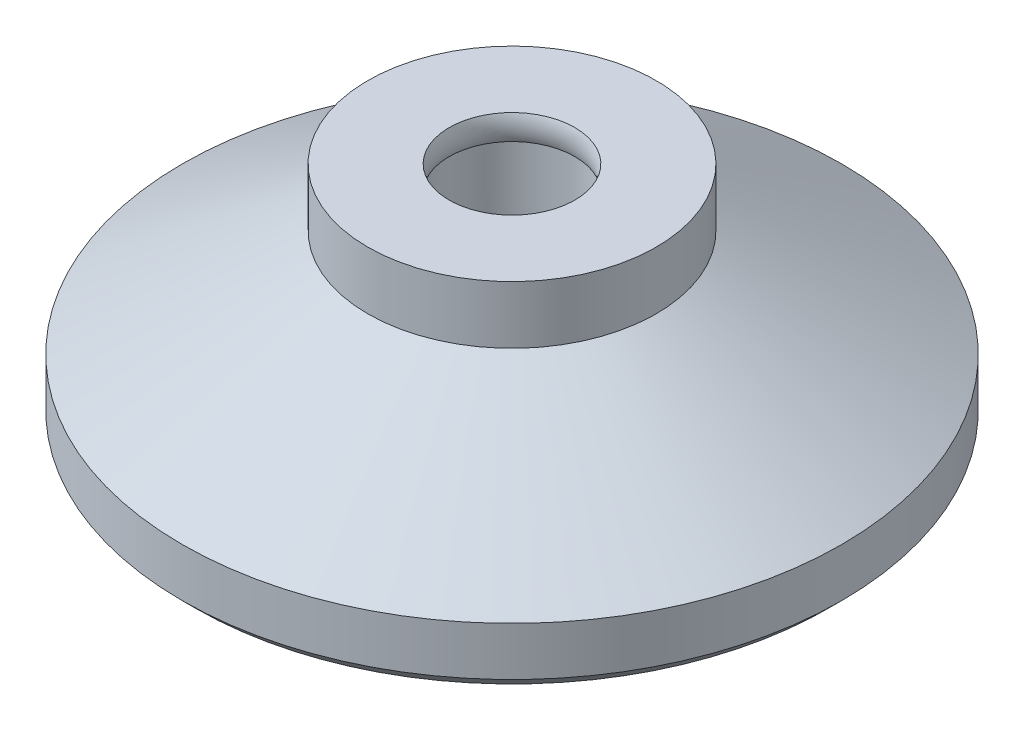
ISO-10303-21;
HEADER;
FILE_DESCRIPTION(('STEP AP214'),'2;1');
FILE_NAME('part.step','',(''),(''),'','','');
FILE_SCHEMA(('AUTOMOTIVE_DESIGN { 1 0 10303 214 1 1 1 1 }'));
ENDSEC;
DATA;
#1=APPLICATION_CONTEXT('core data for automotive mechanical design processes');
#2=APPLICATION_PROTOCOL_DEFINITION('international standard','automotive_design',2000,#1);
#3=PRODUCT_CONTEXT('',#1,'mechanical');
#4=PRODUCT('Part','Part','',(#3));
#5=PRODUCT_RELATED_PRODUCT_CATEGORY('part','',(#4));
#6=PRODUCT_DEFINITION_FORMATION('','',#4);
#7=PRODUCT_DEFINITION_CONTEXT('part definition',#1,'design');
#8=PRODUCT_DEFINITION('design','',#6,#7);
#9=PRODUCT_DEFINITION_SHAPE('','',#8);
#10=(LENGTH_UNIT() NAMED_UNIT(*) SI_UNIT(.MILLI.,.METRE.));
#11=(NAMED_UNIT(*) PLANE_ANGLE_UNIT() SI_UNIT($,.RADIAN.));
#12=(NAMED_UNIT(*) SI_UNIT($,.STERADIAN.) SOLID_ANGLE_UNIT());
#13=UNCERTAINTY_MEASURE_WITH_UNIT(LENGTH_MEASURE(1.E-05),#10,'distance_accuracy_value','');
#14=(GEOMETRIC_REPRESENTATION_CONTEXT(3) GLOBAL_UNCERTAINTY_ASSIGNED_CONTEXT((#13)) GLOBAL_UNIT_ASSIGNED_CONTEXT((#10,
#11,#12)) REPRESENTATION_CONTEXT('',''));
#15=CARTESIAN_POINT('',(0.,0.,0.));
#16=DIRECTION('',(0.,0.,1.));
#17=DIRECTION('',(1.,0.,0.));
#18=AXIS2_PLACEMENT_3D('',#15,#16,#17);
#19=CARTESIAN_POINT('',(0.,5.5,0.));
#20=DIRECTION('',(0.,-1.,0.));
#21=DIRECTION('',(0.,0.,-1.));
#22=AXIS2_PLACEMENT_3D('',#19,#20,#21);
#23=CYLINDRICAL_SURFACE('',#22,7.);
#24=CARTESIAN_POINT('',(0.,2.69615242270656,0.));
#25=DIRECTION('',(0.,1.,0.));
#26=DIRECTION('',(0.,0.,1.));
#27=AXIS2_PLACEMENT_3D('',#24,#25,#26);
#28=CIRCLE('',#27,7.);
#29=CARTESIAN_POINT('',(0.,2.69615242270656,7.));
#30=VERTEX_POINT('',#29);
#31=EDGE_CURVE('E91',#30,#30,#28,.T.);
#32=ORIENTED_EDGE('',*,*,#31,.T.);
#33=EDGE_LOOP('',(#32));
#34=FACE_BOUND('',#33,.T.);
#35=CARTESIAN_POINT('',(0.,5.5,0.));
#36=DIRECTION('',(0.,1.,0.));
#37=DIRECTION('',(0.,0.,1.));
#38=AXIS2_PLACEMENT_3D('',#35,#36,#37);
#39=CIRCLE('',#38,7.);
#40=CARTESIAN_POINT('',(0.,5.5,7.));
#41=VERTEX_POINT('',#40);
#42=EDGE_CURVE('E93',#41,#41,#39,.T.);
#43=ORIENTED_EDGE('',*,*,#42,.F.);
#44=EDGE_LOOP('',(#43));
#45=FACE_BOUND('',#44,.T.);
#46=ADVANCED_FACE('F37',(#34,#45),#23,.T.);
#47=CARTESIAN_POINT('',(0.,5.5,0.));
#48=DIRECTION('',(0.,1.,0.));
#49=DIRECTION('',(0.,0.,1.));
#50=AXIS2_PLACEMENT_3D('',#47,#48,#49);
#51=PLANE('',#50);
#52=CARTESIAN_POINT('',(0.,5.5,0.));
#53=DIRECTION('',(0.,-1.,0.));
#54=DIRECTION('',(0.,0.,-1.));
#55=AXIS2_PLACEMENT_3D('',#52,#53,#54);
#56=CIRCLE('',#55,3.05);
#57=CARTESIAN_POINT('',(0.,5.5,-3.05));
#58=VERTEX_POINT('',#57);
#59=EDGE_CURVE('E113',#58,#58,#56,.T.);
#60=ORIENTED_EDGE('',*,*,#59,.T.);
#61=EDGE_LOOP('',(#60));
#62=FACE_BOUND('',#61,.T.);
#63=ORIENTED_EDGE('',*,*,#42,.T.);
#64=EDGE_LOOP('',(#63));
#65=FACE_BOUND('',#64,.T.);
#66=ADVANCED_FACE('F65',(#62,#65),#51,.T.);
#67=CARTESIAN_POINT('',(0.,2.69615242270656,0.));
#68=DIRECTION('',(0.,-1.,0.));
#69=DIRECTION('',(0.,0.,-1.));
#70=AXIS2_PLACEMENT_3D('',#67,#68,#69);
#71=CONICAL_SURFACE('',#70,7.,1.0471975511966);
#72=CARTESIAN_POINT('',(0.,-2.5,0.));
#73=DIRECTION('',(0.,1.,0.));
#74=DIRECTION('',(0.,0.,1.));
#75=AXIS2_PLACEMENT_3D('',#72,#73,#74);
#76=CIRCLE('',#75,16.);
#77=CARTESIAN_POINT('',(0.,-2.5,16.));
#78=VERTEX_POINT('',#77);
#79=EDGE_CURVE('E89',#78,#78,#76,.T.);
#80=ORIENTED_EDGE('',*,*,#79,.T.);
#81=EDGE_LOOP('',(#80));
#82=FACE_BOUND('',#81,.T.);
#83=ORIENTED_EDGE('',*,*,#31,.F.);
#84=EDGE_LOOP('',(#83));
#85=FACE_BOUND('',#84,.T.);
#86=ADVANCED_FACE('F70',(#82,#85),#71,.T.);
#87=CARTESIAN_POINT('',(0.,-5.5,0.));
#88=DIRECTION('',(0.,1.,0.));
#89=DIRECTION('',(0.,0.,1.));
#90=AXIS2_PLACEMENT_3D('',#87,#88,#89);
#91=PLANE('',#90);
#92=CARTESIAN_POINT('',(0.,-5.5,0.));
#93=DIRECTION('',(0.,1.,0.));
#94=DIRECTION('',(0.,0.,1.));
#95=AXIS2_PLACEMENT_3D('',#92,#93,#94);
#96=CIRCLE('',#95,15.36);
#97=CARTESIAN_POINT('',(0.,-5.5,15.36));
#98=VERTEX_POINT('',#97);
#99=EDGE_CURVE('E45',#98,#98,#96,.F.);
#100=ORIENTED_EDGE('',*,*,#99,.T.);
#101=EDGE_LOOP('',(#100));
#102=FACE_BOUND('',#101,.T.);
#103=ADVANCED_FACE('F76',(#102),#91,.F.);
#104=CARTESIAN_POINT('',(0.,-2.5,0.));
#105=DIRECTION('',(0.,-1.,0.));
#106=DIRECTION('',(0.,0.,-1.));
#107=AXIS2_PLACEMENT_3D('',#104,#105,#106);
#108=CYLINDRICAL_SURFACE('',#107,16.);
#109=CARTESIAN_POINT('',(0.,-4.85999999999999,0.));
#110=DIRECTION('',(0.,1.,0.));
#111=DIRECTION('',(0.,0.,1.));
#112=AXIS2_PLACEMENT_3D('',#109,#110,#111);
#113=CIRCLE('',#112,16.);
#114=CARTESIAN_POINT('',(0.,-4.85999999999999,16.));
#115=VERTEX_POINT('',#114);
#116=EDGE_CURVE('E11',#115,#115,#113,.T.);
#117=ORIENTED_EDGE('',*,*,#116,.T.);
#118=EDGE_LOOP('',(#117));
#119=FACE_BOUND('',#118,.T.);
#120=ORIENTED_EDGE('',*,*,#79,.F.);
#121=EDGE_LOOP('',(#120));
#122=FACE_BOUND('',#121,.T.);
#123=ADVANCED_FACE('F60',(#119,#122),#108,.T.);
#124=CARTESIAN_POINT('',(0.,-5.5,0.));
#125=DIRECTION('',(0.,1.,0.));
#126=DIRECTION('',(0.,0.,1.));
#127=AXIS2_PLACEMENT_3D('',#124,#125,#126);
#128=CONICAL_SURFACE('',#127,15.36,0.785398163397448);
#129=CARTESIAN_POINT('',(0.,-4.85999999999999,16.));
#130=CARTESIAN_POINT('',(0.,-4.86666666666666,15.9933333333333));
#131=CARTESIAN_POINT('',(0.,-4.87333333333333,15.9866666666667));
#132=CARTESIAN_POINT('',(0.,-4.88666666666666,15.9733333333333));
#133=CARTESIAN_POINT('',(0.,-4.89333333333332,15.9666666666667));
#134=CARTESIAN_POINT('',(0.,-4.90666666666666,15.9533333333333));
#135=CARTESIAN_POINT('',(0.,-4.91333333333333,15.9466666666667));
#136=CARTESIAN_POINT('',(0.,-4.92666666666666,15.9333333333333));
#137=CARTESIAN_POINT('',(0.,-4.93333333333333,15.9266666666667));
#138=CARTESIAN_POINT('',(0.,-4.94666666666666,15.9133333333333));
#139=CARTESIAN_POINT('',(0.,-4.95333333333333,15.9066666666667));
#140=CARTESIAN_POINT('',(0.,-4.96666666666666,15.8933333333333));
#141=CARTESIAN_POINT('',(0.,-4.97333333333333,15.8866666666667));
#142=CARTESIAN_POINT('',(0.,-4.98666666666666,15.8733333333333));
#143=CARTESIAN_POINT('',(0.,-4.99333333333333,15.8666666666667));
#144=CARTESIAN_POINT('',(0.,-5.00666666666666,15.8533333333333));
#145=CARTESIAN_POINT('',(0.,-5.01333333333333,15.8466666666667));
#146=CARTESIAN_POINT('',(0.,-5.02666666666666,15.8333333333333));
#147=CARTESIAN_POINT('',(0.,-5.03333333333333,15.8266666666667));
#148=CARTESIAN_POINT('',(0.,-5.04666666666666,15.8133333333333));
#149=CARTESIAN_POINT('',(0.,-5.05333333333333,15.8066666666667));
#150=CARTESIAN_POINT('',(0.,-5.06666666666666,15.7933333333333));
#151=CARTESIAN_POINT('',(0.,-5.07333333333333,15.7866666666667));
#152=CARTESIAN_POINT('',(0.,-5.08666666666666,15.7733333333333));
#153=CARTESIAN_POINT('',(0.,-5.09333333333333,15.7666666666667));
#154=CARTESIAN_POINT('',(0.,-5.10666666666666,15.7533333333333));
#155=CARTESIAN_POINT('',(0.,-5.11333333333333,15.7466666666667));
#156=CARTESIAN_POINT('',(0.,-5.12666666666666,15.7333333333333));
#157=CARTESIAN_POINT('',(0.,-5.13333333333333,15.7266666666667));
#158=CARTESIAN_POINT('',(0.,-5.14666666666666,15.7133333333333));
#159=CARTESIAN_POINT('',(0.,-5.15333333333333,15.7066666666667));
#160=CARTESIAN_POINT('',(0.,-5.16666666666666,15.6933333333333));
#161=CARTESIAN_POINT('',(0.,-5.17333333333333,15.6866666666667));
#162=CARTESIAN_POINT('',(0.,-5.18666666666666,15.6733333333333));
#163=CARTESIAN_POINT('',(0.,-5.19333333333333,15.6666666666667));
#164=CARTESIAN_POINT('',(0.,-5.20666666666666,15.6533333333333));
#165=CARTESIAN_POINT('',(0.,-5.21333333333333,15.6466666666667));
#166=CARTESIAN_POINT('',(0.,-5.22666666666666,15.6333333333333));
#167=CARTESIAN_POINT('',(0.,-5.23333333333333,15.6266666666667));
#168=CARTESIAN_POINT('',(0.,-5.24666666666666,15.6133333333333));
#169=CARTESIAN_POINT('',(0.,-5.25333333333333,15.6066666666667));
#170=CARTESIAN_POINT('',(0.,-5.26666666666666,15.5933333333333));
#171=CARTESIAN_POINT('',(0.,-5.27333333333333,15.5866666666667));
#172=CARTESIAN_POINT('',(0.,-5.28666666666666,15.5733333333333));
#173=CARTESIAN_POINT('',(0.,-5.29333333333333,15.5666666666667));
#174=CARTESIAN_POINT('',(0.,-5.30666666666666,15.5533333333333));
#175=CARTESIAN_POINT('',(0.,-5.31333333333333,15.5466666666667));
#176=CARTESIAN_POINT('',(0.,-5.32666666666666,15.5333333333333));
#177=CARTESIAN_POINT('',(0.,-5.33333333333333,15.5266666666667));
#178=CARTESIAN_POINT('',(0.,-5.34666666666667,15.5133333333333));
#179=CARTESIAN_POINT('',(0.,-5.35333333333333,15.5066666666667));
#180=CARTESIAN_POINT('',(0.,-5.36666666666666,15.4933333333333));
#181=CARTESIAN_POINT('',(0.,-5.37333333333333,15.4866666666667));
#182=CARTESIAN_POINT('',(0.,-5.38666666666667,15.4733333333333));
#183=CARTESIAN_POINT('',(0.,-5.39333333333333,15.4666666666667));
#184=CARTESIAN_POINT('',(0.,-5.40666666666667,15.4533333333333));
#185=CARTESIAN_POINT('',(0.,-5.41333333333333,15.4466666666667));
#186=CARTESIAN_POINT('',(0.,-5.42666666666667,15.4333333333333));
#187=CARTESIAN_POINT('',(0.,-5.43333333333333,15.4266666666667));
#188=CARTESIAN_POINT('',(0.,-5.44666666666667,15.4133333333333));
#189=CARTESIAN_POINT('',(0.,-5.45333333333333,15.4066666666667));
#190=CARTESIAN_POINT('',(0.,-5.46666666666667,15.3933333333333));
#191=CARTESIAN_POINT('',(0.,-5.47333333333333,15.3866666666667));
#192=CARTESIAN_POINT('',(0.,-5.48666666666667,15.3733333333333));
#193=CARTESIAN_POINT('',(0.,-5.49333333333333,15.3666666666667));
#194=CARTESIAN_POINT('',(0.,-5.5,15.36));
#195=B_SPLINE_CURVE_WITH_KNOTS('',3,(#129,#130,#131,#132,#133,#134,#135,#136,#137,#138,#139,
#140,#141,#142,#143,#144,#145,#146,#147,#148,#149,#150,#151,#152,#153,#154,#155,#156,#157,#158,
#159,#160,#161,#162,#163,#164,#165,#166,#167,#168,#169,#170,#171,#172,#173,#174,#175,#176,#177,
#178,#179,#180,#181,#182,#183,#184,#185,#186,#187,#188,#189,#190,#191,#192,#193,#194),
.UNSPECIFIED.,.F.,.F.,(4,2,2,2,2,2,2,2,2,2,2,2,2,2,2,2,2,2,2,2,2,2,2,2,2,2,2,2,2,2,2,2,4),(0.,
0.0282842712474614,0.0565685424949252,0.0848528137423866,0.113137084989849,0.141421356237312,
0.169705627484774,0.197989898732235,0.2262741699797,0.254558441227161,0.282842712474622,
0.311126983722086,0.339411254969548,0.367695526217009,0.395979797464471,0.424264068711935,
0.452548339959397,0.480832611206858,0.509116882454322,0.537401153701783,0.565685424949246,
0.593969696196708,0.62225396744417,0.650538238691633,0.678822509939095,0.707106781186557,
0.735391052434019,0.763675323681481,0.791959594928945,0.820243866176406,0.848528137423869,
0.876812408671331,0.905096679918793),.UNSPECIFIED.);
#196=EDGE_CURVE('BSEAM39',#115,#98,#195,.T.);
#197=ORIENTED_EDGE('',*,*,#116,.F.);
#198=ORIENTED_EDGE('',*,*,#99,.F.);
#199=ORIENTED_EDGE('',*,*,#196,.T.);
#200=ORIENTED_EDGE('',*,*,#196,.F.);
#201=EDGE_LOOP('',(#197,#199,#198,#200));
#202=FACE_BOUND('',#201,.T.);
#203=ADVANCED_FACE('F39',(#202),#128,.T.);
#204=CARTESIAN_POINT('',(0.,-2.5,0.));
#205=DIRECTION('',(0.,1.,0.));
#206=DIRECTION('',(0.,0.,1.));
#207=AXIS2_PLACEMENT_3D('',#204,#205,#206);
#208=CONICAL_SURFACE('',#207,0.,1.04719755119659);
#209=CARTESIAN_POINT('',(0.,-0.739081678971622,0.));
#210=DIRECTION('',(0.,-1.,0.));
#211=DIRECTION('',(0.,0.,-1.));
#212=AXIS2_PLACEMENT_3D('',#209,#210,#211);
#213=CIRCLE('',#212,3.05);
#214=CARTESIAN_POINT('',(0.,-0.739081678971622,-3.05));
#215=VERTEX_POINT('',#214);
#216=EDGE_CURVE('E100',#215,#215,#213,.T.);
#217=ORIENTED_EDGE('',*,*,#216,.F.);
#218=EDGE_LOOP('',(#217));
#219=FACE_BOUND('',#218,.T.);
#220=CARTESIAN_POINT('',(0.,-2.5,0.));
#221=VERTEX_POINT('',#220);
#222=VERTEX_LOOP('',#221);
#223=FACE_BOUND('',#222,.T.);
#224=ADVANCED_FACE('F48',(#219,#223),#208,.F.);
#225=CARTESIAN_POINT('',(0.,0.,0.));
#226=DIRECTION('',(0.,-1.,0.));
#227=DIRECTION('',(0.,0.,-1.));
#228=AXIS2_PLACEMENT_3D('',#225,#226,#227);
#229=CYLINDRICAL_SURFACE('',#228,3.05);
#230=CARTESIAN_POINT('',(0.,4.28,0.));
#231=DIRECTION('',(0.,-1.,0.));
#232=DIRECTION('',(0.,0.,-1.));
#233=AXIS2_PLACEMENT_3D('',#230,#231,#232);
#234=CIRCLE('',#233,3.05);
#235=CARTESIAN_POINT('',(0.,4.28,-3.05));
#236=VERTEX_POINT('',#235);
#237=EDGE_CURVE('E109',#236,#236,#234,.T.);
#238=ORIENTED_EDGE('',*,*,#237,.F.);
#239=EDGE_LOOP('',(#238));
#240=FACE_BOUND('',#239,.T.);
#241=ORIENTED_EDGE('',*,*,#216,.T.);
#242=EDGE_LOOP('',(#241));
#243=FACE_BOUND('',#242,.T.);
#244=ADVANCED_FACE('F50',(#240,#243),#229,.F.);
#245=CARTESIAN_POINT('',(0.,4.89,0.));
#246=DIRECTION('',(0.,-1.,0.));
#247=DIRECTION('',(0.,0.,-1.));
#248=AXIS2_PLACEMENT_3D('',#245,#246,#247);
#249=TOROIDAL_SURFACE('',#248,4.514,1.586);
#250=ORIENTED_EDGE('',*,*,#59,.F.);
#251=EDGE_LOOP('',(#250));
#252=FACE_BOUND('',#251,.T.);
#253=ORIENTED_EDGE('',*,*,#237,.T.);
#254=EDGE_LOOP('',(#253));
#255=FACE_BOUND('',#254,.T.);
#256=ADVANCED_FACE('F57',(#252,#255),#249,.T.);
#257=CLOSED_SHELL('',(#46,#66,#86,#103,#123,#203,#224,#244,#256));
#258=MANIFOLD_SOLID_BREP('B2',#257);
#259=ADVANCED_BREP_SHAPE_REPRESENTATION('',(#18,#258),#14);
#260=SHAPE_DEFINITION_REPRESENTATION(#9,#259);
ENDSEC;
END-ISO-10303-21;
